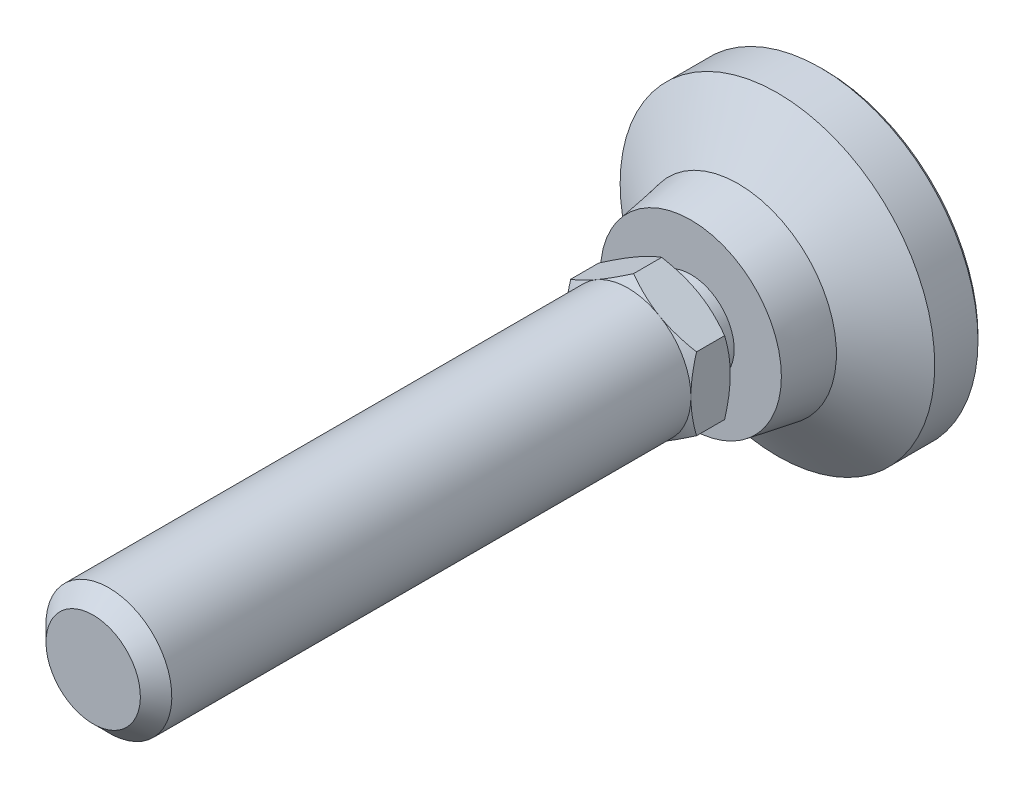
ISO-10303-21;
HEADER;
FILE_DESCRIPTION(('STEP AP214'),'2;1');
FILE_NAME('part.step','',(''),(''),'','','');
FILE_SCHEMA(('AUTOMOTIVE_DESIGN { 1 0 10303 214 1 1 1 1 }'));
ENDSEC;
DATA;
#1=APPLICATION_CONTEXT('core data for automotive mechanical design processes');
#2=APPLICATION_PROTOCOL_DEFINITION('international standard','automotive_design',2000,#1);
#3=PRODUCT_CONTEXT('',#1,'mechanical');
#4=PRODUCT('Part','Part','',(#3));
#5=PRODUCT_RELATED_PRODUCT_CATEGORY('part','',(#4));
#6=PRODUCT_DEFINITION_FORMATION('','',#4);
#7=PRODUCT_DEFINITION_CONTEXT('part definition',#1,'design');
#8=PRODUCT_DEFINITION('design','',#6,#7);
#9=PRODUCT_DEFINITION_SHAPE('','',#8);
#10=(LENGTH_UNIT() NAMED_UNIT(*) SI_UNIT(.MILLI.,.METRE.));
#11=(NAMED_UNIT(*) PLANE_ANGLE_UNIT() SI_UNIT($,.RADIAN.));
#12=(NAMED_UNIT(*) SI_UNIT($,.STERADIAN.) SOLID_ANGLE_UNIT());
#13=UNCERTAINTY_MEASURE_WITH_UNIT(LENGTH_MEASURE(1.E-05),#10,'distance_accuracy_value','');
#14=(GEOMETRIC_REPRESENTATION_CONTEXT(3) GLOBAL_UNCERTAINTY_ASSIGNED_CONTEXT((#13)) GLOBAL_UNIT_ASSIGNED_CONTEXT((#10,
#11,#12)) REPRESENTATION_CONTEXT('',''));
#15=CARTESIAN_POINT('',(0.,0.,0.));
#16=DIRECTION('',(0.,0.,1.));
#17=DIRECTION('',(1.,0.,0.));
#18=AXIS2_PLACEMENT_3D('',#15,#16,#17);
#19=CARTESIAN_POINT('',(0.,-5.50000000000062,19.9999999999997));
#20=DIRECTION('',(0.,0.,-1.));
#21=DIRECTION('',(0.,1.,0.));
#22=AXIS2_PLACEMENT_3D('',#19,#20,#21);
#23=PLANE('',#22);
#24=CARTESIAN_POINT('',(0.,0.,19.9999999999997));
#25=DIRECTION('',(0.,0.,-1.));
#26=DIRECTION('',(0.,1.,0.));
#27=AXIS2_PLACEMENT_3D('',#24,#25,#26);
#28=CIRCLE('',#27,5.50000000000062);
#29=CARTESIAN_POINT('',(0.,5.50000000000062,19.9999999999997));
#30=VERTEX_POINT('',#29);
#31=EDGE_CURVE('E286',#30,#30,#28,.T.);
#32=ORIENTED_EDGE('',*,*,#31,.F.);
#33=EDGE_LOOP('',(#32));
#34=FACE_BOUND('',#33,.T.);
#35=CARTESIAN_POINT('',(0.,0.,19.9999999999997));
#36=DIRECTION('',(0.,0.,-1.));
#37=DIRECTION('',(0.,1.,0.));
#38=AXIS2_PLACEMENT_3D('',#35,#36,#37);
#39=CIRCLE('',#38,8.00000000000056);
#40=CARTESIAN_POINT('',(-4.00000000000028,6.928203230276,19.9999999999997));
#41=VERTEX_POINT('',#40);
#42=CARTESIAN_POINT('',(4.00000000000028,6.928203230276,19.9999999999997));
#43=VERTEX_POINT('',#42);
#44=EDGE_CURVE('E18',#41,#43,#39,.T.);
#45=ORIENTED_EDGE('',*,*,#44,.T.);
#46=CARTESIAN_POINT('',(0.,0.,19.9999999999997));
#47=DIRECTION('',(0.,0.,-1.));
#48=DIRECTION('',(0.,1.,0.));
#49=AXIS2_PLACEMENT_3D('',#46,#47,#48);
#50=CIRCLE('',#49,8.00000000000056);
#51=CARTESIAN_POINT('',(8.00000000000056,0.,19.9999999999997));
#52=VERTEX_POINT('',#51);
#53=EDGE_CURVE('E30',#43,#52,#50,.T.);
#54=ORIENTED_EDGE('',*,*,#53,.T.);
#55=CARTESIAN_POINT('',(4.00000000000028,-6.928203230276,19.9999999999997));
#56=VERTEX_POINT('',#55);
#57=EDGE_CURVE('E9',#52,#56,#39,.T.);
#58=ORIENTED_EDGE('',*,*,#57,.T.);
#59=CARTESIAN_POINT('',(-4.00000000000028,-6.928203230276,19.9999999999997));
#60=VERTEX_POINT('',#59);
#61=EDGE_CURVE('E23',#56,#60,#39,.T.);
#62=ORIENTED_EDGE('',*,*,#61,.T.);
#63=CARTESIAN_POINT('',(-8.00000000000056,0.,19.9999999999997));
#64=VERTEX_POINT('',#63);
#65=EDGE_CURVE('E267',#60,#64,#39,.T.);
#66=ORIENTED_EDGE('',*,*,#65,.T.);
#67=EDGE_CURVE('E268',#64,#41,#39,.T.);
#68=ORIENTED_EDGE('',*,*,#67,.T.);
#69=EDGE_LOOP('',(#45,#54,#58,#62,#66,#68));
#70=FACE_BOUND('',#69,.T.);
#71=ADVANCED_FACE('F14',(#34,#70),#23,.T.);
#72=CARTESIAN_POINT('',(0.,0.,-1.));
#73=DIRECTION('',(0.,0.,-1.));
#74=DIRECTION('',(0.,1.,0.));
#75=AXIS2_PLACEMENT_3D('',#72,#73,#74);
#76=CYLINDRICAL_SURFACE('',#75,20.);
#77=CARTESIAN_POINT('',(0.,0.,0.500000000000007));
#78=DIRECTION('',(0.,0.,-1.));
#79=DIRECTION('',(0.,1.,0.));
#80=AXIS2_PLACEMENT_3D('',#77,#78,#79);
#81=CIRCLE('',#80,20.);
#82=CARTESIAN_POINT('',(0.,20.,0.500000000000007));
#83=VERTEX_POINT('',#82);
#84=EDGE_CURVE('E312',#83,#83,#81,.F.);
#85=ORIENTED_EDGE('',*,*,#84,.T.);
#86=EDGE_LOOP('',(#85));
#87=FACE_BOUND('',#86,.T.);
#88=CARTESIAN_POINT('',(0.,0.,6.));
#89=DIRECTION('',(0.,0.,-1.));
#90=DIRECTION('',(0.,1.,0.));
#91=AXIS2_PLACEMENT_3D('',#88,#89,#90);
#92=CIRCLE('',#91,20.);
#93=CARTESIAN_POINT('',(0.,20.,6.));
#94=VERTEX_POINT('',#93);
#95=EDGE_CURVE('E287',#94,#94,#92,.T.);
#96=ORIENTED_EDGE('',*,*,#95,.T.);
#97=EDGE_LOOP('',(#96));
#98=FACE_BOUND('',#97,.T.);
#99=ADVANCED_FACE('F335',(#87,#98),#76,.T.);
#100=CARTESIAN_POINT('',(0.,0.,-1.));
#101=DIRECTION('',(0.,0.,-1.));
#102=DIRECTION('',(0.,1.,0.));
#103=AXIS2_PLACEMENT_3D('',#100,#101,#102);
#104=CYLINDRICAL_SURFACE('',#103,5.50000000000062);
#105=CARTESIAN_POINT('',(0.,0.,17.));
#106=DIRECTION('',(0.,0.,-1.));
#107=DIRECTION('',(0.,1.,0.));
#108=AXIS2_PLACEMENT_3D('',#105,#106,#107);
#109=CIRCLE('',#108,5.50000000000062);
#110=CARTESIAN_POINT('',(0.,5.50000000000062,17.));
#111=VERTEX_POINT('',#110);
#112=EDGE_CURVE('E297',#111,#111,#109,.T.);
#113=ORIENTED_EDGE('',*,*,#112,.F.);
#114=EDGE_LOOP('',(#113));
#115=FACE_BOUND('',#114,.T.);
#116=ORIENTED_EDGE('',*,*,#31,.T.);
#117=EDGE_LOOP('',(#116));
#118=FACE_BOUND('',#117,.T.);
#119=ADVANCED_FACE('F341',(#115,#118),#104,.T.);
#120=CARTESIAN_POINT('',(-11.5,0.,17.));
#121=DIRECTION('',(0.,0.,-1.));
#122=DIRECTION('',(0.,1.,0.));
#123=AXIS2_PLACEMENT_3D('',#120,#121,#122);
#124=PLANE('',#123);
#125=CARTESIAN_POINT('',(0.,0.,17.));
#126=DIRECTION('',(0.,0.,-1.));
#127=DIRECTION('',(0.,1.,0.));
#128=AXIS2_PLACEMENT_3D('',#125,#126,#127);
#129=CIRCLE('',#128,11.5);
#130=CARTESIAN_POINT('',(0.,11.5,17.));
#131=VERTEX_POINT('',#130);
#132=EDGE_CURVE('E294',#131,#131,#129,.T.);
#133=ORIENTED_EDGE('',*,*,#132,.F.);
#134=EDGE_LOOP('',(#133));
#135=FACE_BOUND('',#134,.T.);
#136=ORIENTED_EDGE('',*,*,#112,.T.);
#137=EDGE_LOOP('',(#136));
#138=FACE_BOUND('',#137,.T.);
#139=ADVANCED_FACE('F532',(#135,#138),#124,.F.);
#140=CARTESIAN_POINT('',(0.,0.,17.));
#141=DIRECTION('',(0.,0.,-1.));
#142=DIRECTION('',(0.,1.,0.));
#143=AXIS2_PLACEMENT_3D('',#140,#141,#142);
#144=CONICAL_SURFACE('',#143,11.5,0.165148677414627);
#145=CARTESIAN_POINT('',(0.,0.,11.));
#146=DIRECTION('',(0.,0.,-1.));
#147=DIRECTION('',(0.,1.,0.));
#148=AXIS2_PLACEMENT_3D('',#145,#146,#147);
#149=CIRCLE('',#148,12.5);
#150=CARTESIAN_POINT('',(0.,12.5,11.));
#151=VERTEX_POINT('',#150);
#152=EDGE_CURVE('E290',#151,#151,#149,.T.);
#153=ORIENTED_EDGE('',*,*,#152,.F.);
#154=EDGE_LOOP('',(#153));
#155=FACE_BOUND('',#154,.T.);
#156=ORIENTED_EDGE('',*,*,#132,.T.);
#157=EDGE_LOOP('',(#156));
#158=FACE_BOUND('',#157,.T.);
#159=ADVANCED_FACE('F523',(#155,#158),#144,.T.);
#160=CARTESIAN_POINT('',(0.,0.,11.));
#161=DIRECTION('',(0.,0.,-1.));
#162=DIRECTION('',(0.,1.,0.));
#163=AXIS2_PLACEMENT_3D('',#160,#161,#162);
#164=CONICAL_SURFACE('',#163,12.5,0.982793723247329);
#165=ORIENTED_EDGE('',*,*,#95,.F.);
#166=EDGE_LOOP('',(#165));
#167=FACE_BOUND('',#166,.T.);
#168=ORIENTED_EDGE('',*,*,#152,.T.);
#169=EDGE_LOOP('',(#168));
#170=FACE_BOUND('',#169,.T.);
#171=ADVANCED_FACE('F516',(#167,#170),#164,.T.);
#172=CARTESIAN_POINT('',(0.,0.,0.));
#173=DIRECTION('',(0.,0.,-1.));
#174=DIRECTION('',(0.,1.,0.));
#175=AXIS2_PLACEMENT_3D('',#172,#173,#174);
#176=PLANE('',#175);
#177=CARTESIAN_POINT('',(0.,0.,0.));
#178=DIRECTION('',(0.,0.,-1.));
#179=DIRECTION('',(0.,1.,0.));
#180=AXIS2_PLACEMENT_3D('',#177,#178,#179);
#181=CIRCLE('',#180,19.5);
#182=CARTESIAN_POINT('',(0.,19.5,0.));
#183=VERTEX_POINT('',#182);
#184=EDGE_CURVE('E310',#183,#183,#181,.T.);
#185=ORIENTED_EDGE('',*,*,#184,.T.);
#186=EDGE_LOOP('',(#185));
#187=FACE_BOUND('',#186,.T.);
#188=ADVANCED_FACE('F233',(#187),#176,.T.);
#189=CARTESIAN_POINT('',(0.,0.,0.));
#190=DIRECTION('',(0.,0.,1.));
#191=DIRECTION('',(0.,-1.,0.));
#192=AXIS2_PLACEMENT_3D('',#189,#190,#191);
#193=CONICAL_SURFACE('',#192,19.5,0.785398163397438);
#194=ORIENTED_EDGE('',*,*,#84,.F.);
#195=EDGE_LOOP('',(#194));
#196=FACE_BOUND('',#195,.T.);
#197=ORIENTED_EDGE('',*,*,#184,.F.);
#198=EDGE_LOOP('',(#197));
#199=FACE_BOUND('',#198,.T.);
#200=ADVANCED_FACE('F16',(#196,#199),#193,.T.);
#201=CARTESIAN_POINT('',(0.,0.,19.9999999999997));
#202=DIRECTION('',(0.,0.,1.));
#203=DIRECTION('',(0.,-1.,0.));
#204=AXIS2_PLACEMENT_3D('',#201,#202,#203);
#205=CONICAL_SURFACE('',#204,8.00000000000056,1.0471975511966);
#206=ORIENTED_EDGE('',*,*,#44,.F.);
#207=CARTESIAN_POINT('',(0.000200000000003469,9.23771977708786,20.7145978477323));
#208=CARTESIAN_POINT('',(-0.175648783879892,9.13619343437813,20.6559907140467));
#209=CARTESIAN_POINT('',(-0.35215319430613,9.03428856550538,20.6000434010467));
#210=CARTESIAN_POINT('',(-0.706595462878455,8.82965122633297,20.494201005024));
#211=CARTESIAN_POINT('',(-0.884533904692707,8.72691841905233,20.4443085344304));
#212=CARTESIAN_POINT('',(-1.42119823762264,8.41707512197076,20.3046927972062));
#213=CARTESIAN_POINT('',(-1.78204258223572,8.20874154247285,20.2252811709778));
#214=CARTESIAN_POINT('',(-2.32203917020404,7.89697436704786,20.1321616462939));
#215=CARTESIAN_POINT('',(-2.49957818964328,7.79447216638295,20.1056345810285));
#216=CARTESIAN_POINT('',(-2.85545911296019,7.58900421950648,20.0611531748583));
#217=CARTESIAN_POINT('',(-3.03380094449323,7.48603851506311,20.043198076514));
#218=CARTESIAN_POINT('',(-3.39079168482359,7.27992981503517,20.0163156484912));
#219=CARTESIAN_POINT('',(-3.5694400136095,7.17678715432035,20.0073780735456));
#220=CARTESIAN_POINT('',(-3.92690170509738,6.97040655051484,19.9987223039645));
#221=CARTESIAN_POINT('',(-4.10571506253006,6.86716861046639,19.9990038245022));
#222=CARTESIAN_POINT('',(-4.4400133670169,6.67416139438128,20.0081450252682));
#223=CARTESIAN_POINT('',(-4.59552190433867,6.58437849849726,20.0158896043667));
#224=CARTESIAN_POINT('',(-4.90617476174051,6.40502298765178,20.0382011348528));
#225=CARTESIAN_POINT('',(-5.06131905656,6.31545038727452,20.0527685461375));
#226=CARTESIAN_POINT('',(-5.52615131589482,6.04707935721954,20.1063606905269));
#227=CARTESIAN_POINT('',(-5.83501648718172,5.86875596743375,20.1552686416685));
#228=CARTESIAN_POINT('',(-6.4560232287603,5.51021755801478,20.2775394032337));
#229=CARTESIAN_POINT('',(-6.76808554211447,5.33004829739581,20.3514205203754));
#230=CARTESIAN_POINT('',(-7.38755648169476,4.97239658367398,20.5191001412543));
#231=CARTESIAN_POINT('',(-7.69497304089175,4.79490955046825,20.6128592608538));
#232=CARTESIAN_POINT('',(-8.0002,4.61868668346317,20.7145978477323));
#233=B_SPLINE_CURVE_WITH_KNOTS('',3,(#207,#208,#209,#210,#211,#212,#213,#214,#215,#216,#217,
#218,#219,#220,#221,#222,#223,#224,#225,#226,#227,#228,#229,#230,#231,#232),.UNSPECIFIED.,.F.,
.F.,(4,2,2,2,2,2,2,2,2,2,2,2,4),(0.,0.633973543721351,1.26821965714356,2.53934712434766,
3.15934343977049,3.77928496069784,4.39852133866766,5.01773858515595,5.55680239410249,
6.09590254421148,7.17487077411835,8.27776850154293,9.37850115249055),.UNSPECIFIED.);
#234=CARTESIAN_POINT('',(0.,9.23760430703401,20.7145311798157));
#235=VERTEX_POINT('',#234);
#236=EDGE_CURVE('E242',#235,#41,#233,.T.);
#237=ORIENTED_EDGE('',*,*,#236,.F.);
#238=CARTESIAN_POINT('',(8.0002,4.61868668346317,20.7145978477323));
#239=CARTESIAN_POINT('',(7.8243512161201,4.7202130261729,20.6559907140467));
#240=CARTESIAN_POINT('',(7.64784680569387,4.82211789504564,20.6000434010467));
#241=CARTESIAN_POINT('',(7.29340453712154,5.02675523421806,20.494201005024));
#242=CARTESIAN_POINT('',(7.11546609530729,5.1294880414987,20.4443085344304));
#243=CARTESIAN_POINT('',(6.57880176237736,5.43933133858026,20.3046927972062));
#244=CARTESIAN_POINT('',(6.21795741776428,5.64766491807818,20.2252811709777));
#245=CARTESIAN_POINT('',(5.67796082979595,5.95943209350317,20.1321616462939));
#246=CARTESIAN_POINT('',(5.50042181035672,6.06193429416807,20.1056345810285));
#247=CARTESIAN_POINT('',(5.1445408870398,6.26740224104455,20.0611531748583));
#248=CARTESIAN_POINT('',(4.96619905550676,6.37036794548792,20.043198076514));
#249=CARTESIAN_POINT('',(4.60920831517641,6.57647664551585,20.0163156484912));
#250=CARTESIAN_POINT('',(4.4305599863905,6.67961930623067,20.0073780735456));
#251=CARTESIAN_POINT('',(4.07309829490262,6.88599991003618,19.9987223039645));
#252=CARTESIAN_POINT('',(3.89428493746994,6.98923785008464,19.9990038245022));
#253=CARTESIAN_POINT('',(3.5599866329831,7.18224506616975,20.0081450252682));
#254=CARTESIAN_POINT('',(3.40447809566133,7.27202796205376,20.0158896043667));
#255=CARTESIAN_POINT('',(3.09382523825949,7.45138347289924,20.0382011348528));
#256=CARTESIAN_POINT('',(2.93868094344,7.54095607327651,20.0527685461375));
#257=CARTESIAN_POINT('',(2.47384868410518,7.80932710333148,20.1063606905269));
#258=CARTESIAN_POINT('',(2.16498351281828,7.98765049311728,20.1552686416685));
#259=CARTESIAN_POINT('',(1.5439767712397,8.34618890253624,20.2775394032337));
#260=CARTESIAN_POINT('',(1.23191445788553,8.52635816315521,20.3514205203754));
#261=CARTESIAN_POINT('',(0.612443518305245,8.88400987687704,20.5191001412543));
#262=CARTESIAN_POINT('',(0.305026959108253,9.06149691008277,20.6128592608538));
#263=CARTESIAN_POINT('',(-0.000199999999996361,9.23771977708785,20.7145978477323));
#264=B_SPLINE_CURVE_WITH_KNOTS('',3,(#238,#239,#240,#241,#242,#243,#244,#245,#246,#247,#248,
#249,#250,#251,#252,#253,#254,#255,#256,#257,#258,#259,#260,#261,#262,#263),.UNSPECIFIED.,.F.,
.F.,(4,2,2,2,2,2,2,2,2,2,2,2,4),(0.,0.633973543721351,1.26821965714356,2.53934712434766,
3.15934343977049,3.77928496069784,4.39852133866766,5.01773858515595,5.55680239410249,
6.09590254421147,7.17487077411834,8.27776850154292,9.37850115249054),.UNSPECIFIED.);
#265=EDGE_CURVE('E241',#43,#235,#264,.T.);
#266=ORIENTED_EDGE('',*,*,#265,.F.);
#267=EDGE_LOOP('',(#206,#237,#266));
#268=FACE_BOUND('',#267,.T.);
#269=ADVANCED_FACE('F324',(#268),#205,.T.);
#270=CARTESIAN_POINT('',(-8.,4.61880215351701,20.7145311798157));
#271=VERTEX_POINT('',#270);
#272=EDGE_CURVE('E126',#41,#271,#233,.T.);
#273=ORIENTED_EDGE('',*,*,#272,.F.);
#274=ORIENTED_EDGE('',*,*,#67,.F.);
#275=CARTESIAN_POINT('',(-8.,12.3496151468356,23.8765494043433));
#276=CARTESIAN_POINT('',(-8.,12.0006820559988,23.7075157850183));
#277=CARTESIAN_POINT('',(-8.,11.6509418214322,23.5401195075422));
#278=CARTESIAN_POINT('',(-8.,10.9494176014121,23.2095236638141));
#279=CARTESIAN_POINT('',(-8.,10.5976332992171,23.0463247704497));
#280=CARTESIAN_POINT('',(-8.,9.88975139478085,22.7242123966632));
#281=CARTESIAN_POINT('',(-8.,9.5336406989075,22.5653275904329));
#282=CARTESIAN_POINT('',(-8.,8.81856698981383,22.2541366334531));
#283=CARTESIAN_POINT('',(-8.,8.45960411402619,22.1018301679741));
#284=CARTESIAN_POINT('',(-8.,7.72687977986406,21.8008622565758));
#285=CARTESIAN_POINT('',(-8.,7.35300841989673,21.6524668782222));
#286=CARTESIAN_POINT('',(-8.,6.60087150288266,21.3670459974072));
#287=CARTESIAN_POINT('',(-8.,6.22260545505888,21.2300217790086));
#288=CARTESIAN_POINT('',(-8.,5.46179948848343,20.9709827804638));
#289=CARTESIAN_POINT('',(-8.,5.07927020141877,20.8489371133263));
#290=CARTESIAN_POINT('',(-8.,4.30873883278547,20.6238073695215));
#291=CARTESIAN_POINT('',(-8.,3.92073853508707,20.5207172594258));
#292=CARTESIAN_POINT('',(-8.,3.14112823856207,20.3390370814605));
#293=CARTESIAN_POINT('',(-8.,2.74954963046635,20.2603159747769));
#294=CARTESIAN_POINT('',(-8.,2.15866192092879,20.1639462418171));
#295=CARTESIAN_POINT('',(-8.,1.96109773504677,20.135440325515));
#296=CARTESIAN_POINT('',(-8.,1.56500689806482,20.0862261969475));
#297=CARTESIAN_POINT('',(-8.,1.36648034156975,20.0655172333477));
#298=CARTESIAN_POINT('',(-8.,0.97129865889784,20.03256633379));
#299=CARTESIAN_POINT('',(-8.,0.774652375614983,20.0202187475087));
#300=CARTESIAN_POINT('',(-8.,0.381014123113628,20.0038464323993));
#301=CARTESIAN_POINT('',(-8.,0.184022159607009,19.9998215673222));
#302=CARTESIAN_POINT('',(-8.,-0.209955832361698,20.0001905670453));
#303=CARTESIAN_POINT('',(-8.,-0.406941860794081,20.0045844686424));
#304=CARTESIAN_POINT('',(-8.,-0.800555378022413,20.0216845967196));
#305=CARTESIAN_POINT('',(-8.,-0.997182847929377,20.0343912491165));
#306=CARTESIAN_POINT('',(-8.,-1.47149398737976,20.0748020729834));
#307=CARTESIAN_POINT('',(-8.,-1.74884040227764,20.1065478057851));
#308=CARTESIAN_POINT('',(-8.,-2.30142392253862,20.1848324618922));
#309=CARTESIAN_POINT('',(-8.,-2.57666072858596,20.2313734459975));
#310=CARTESIAN_POINT('',(-8.,-3.39892148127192,20.3907170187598));
#311=CARTESIAN_POINT('',(-8.,-3.94217741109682,20.523209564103));
#312=CARTESIAN_POINT('',(-8.,-4.75439104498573,20.7523170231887));
#313=CARTESIAN_POINT('',(-8.,-5.02757821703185,20.8347949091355));
#314=CARTESIAN_POINT('',(-8.,-5.5712982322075,21.0081570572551));
#315=CARTESIAN_POINT('',(-8.,-5.84183105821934,21.0990413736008));
#316=CARTESIAN_POINT('',(-8.,-6.38033035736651,21.2877715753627));
#317=CARTESIAN_POINT('',(-8.,-6.64829768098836,21.3856150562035));
#318=CARTESIAN_POINT('',(-8.,-7.18202324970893,21.5871283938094));
#319=CARTESIAN_POINT('',(-8.,-7.44778151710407,21.6907981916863));
#320=CARTESIAN_POINT('',(-8.,-8.0598054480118,21.9360406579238));
#321=CARTESIAN_POINT('',(-8.,-8.40536863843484,22.079362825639));
#322=CARTESIAN_POINT('',(-8.,-9.09367440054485,22.372645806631));
#323=CARTESIAN_POINT('',(-8.,-9.43641681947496,22.5226069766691));
#324=CARTESIAN_POINT('',(-8.,-10.1195796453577,22.8278774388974));
#325=CARTESIAN_POINT('',(-8.,-10.4599996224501,22.983187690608));
#326=CARTESIAN_POINT('',(-8.,-11.1388422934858,23.298120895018));
#327=CARTESIAN_POINT('',(-8.,-11.4772649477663,23.457743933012));
#328=CARTESIAN_POINT('',(-8.,-12.1527555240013,23.7806734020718));
#329=CARTESIAN_POINT('',(-8.,-12.4898217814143,23.9439833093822));
#330=CARTESIAN_POINT('',(-8.,-13.1625242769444,24.2735248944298));
#331=CARTESIAN_POINT('',(-8.,-13.4981605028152,24.4397565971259));
#332=CARTESIAN_POINT('',(-8.,-14.5031753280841,24.9420390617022));
#333=CARTESIAN_POINT('',(-8.,-15.1707413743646,25.2817163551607));
#334=CARTESIAN_POINT('',(-8.,-16.4489507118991,25.9404306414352));
#335=CARTESIAN_POINT('',(-8.,-17.0598673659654,26.2589394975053));
#336=CARTESIAN_POINT('',(-8.,-18.279406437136,26.9003627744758));
#337=CARTESIAN_POINT('',(-8.,-18.8880287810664,27.2232773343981));
#338=CARTESIAN_POINT('',(-8.,-20.1020595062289,27.8717232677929));
#339=CARTESIAN_POINT('',(-8.,-20.7074720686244,28.1972468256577));
#340=CARTESIAN_POINT('',(-8.,-21.9168207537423,28.8509519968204));
#341=CARTESIAN_POINT('',(-8.,-22.5207569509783,29.1791334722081));
#342=CARTESIAN_POINT('',(-8.,-23.124145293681,29.5083123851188));
#343=B_SPLINE_CURVE_WITH_KNOTS('',3,(#275,#276,#277,#278,#279,#280,#281,#282,#283,#284,#285,
#286,#287,#288,#289,#290,#291,#292,#293,#294,#295,#296,#297,#298,#299,#300,#301,#302,#303,#304,
#305,#306,#307,#308,#309,#310,#311,#312,#313,#314,#315,#316,#317,#318,#319,#320,#321,#322,#323,
#324,#325,#326,#327,#328,#329,#330,#331,#332,#333,#334,#335,#336,#337,#338,#339,#340,#341,#342),
.UNSPECIFIED.,.F.,.F.,(4,2,2,2,2,2,2,2,2,2,2,2,2,2,2,2,2,2,2,2,2,2,2,2,2,2,2,2,2,2,2,2,2,4),(0.,
1.16317396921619,2.32653326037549,3.49632308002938,4.66605687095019,5.87264817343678,
7.07937554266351,8.28357117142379,9.48738284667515,10.684604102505,11.2833047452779,
11.8819476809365,12.4728777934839,13.0637982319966,13.6547212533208,14.2456745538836,
15.0826723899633,15.9197868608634,17.5949709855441,18.45100009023,19.307034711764,
20.1627749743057,21.0185065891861,22.1407322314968,23.2630182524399,24.3855066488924,
25.5080172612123,26.6316345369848,27.7552614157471,30.0022444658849,32.0691077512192,
34.1360364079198,36.1981665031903,38.2601902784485),.UNSPECIFIED.);
#344=EDGE_CURVE('E38',#271,#64,#343,.T.);
#345=ORIENTED_EDGE('',*,*,#344,.F.);
#346=EDGE_LOOP('',(#273,#274,#345));
#347=FACE_BOUND('',#346,.T.);
#348=ADVANCED_FACE('F155',(#347),#205,.T.);
#349=CARTESIAN_POINT('',(-8.,-4.618802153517,20.7145311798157));
#350=VERTEX_POINT('',#349);
#351=EDGE_CURVE('E243',#64,#350,#343,.T.);
#352=ORIENTED_EDGE('',*,*,#351,.F.);
#353=ORIENTED_EDGE('',*,*,#65,.F.);
#354=CARTESIAN_POINT('',(-8.0002,-4.61868668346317,20.7145978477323));
#355=CARTESIAN_POINT('',(-7.8243512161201,-4.7202130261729,20.6559907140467));
#356=CARTESIAN_POINT('',(-7.64784680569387,-4.82211789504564,20.6000434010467));
#357=CARTESIAN_POINT('',(-7.29340453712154,-5.02675523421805,20.494201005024));
#358=CARTESIAN_POINT('',(-7.11546609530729,-5.12948804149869,20.4443085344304));
#359=CARTESIAN_POINT('',(-6.57880176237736,-5.43933133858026,20.3046927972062));
#360=CARTESIAN_POINT('',(-6.21795741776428,-5.64766491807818,20.2252811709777));
#361=CARTESIAN_POINT('',(-5.67796082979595,-5.95943209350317,20.1321616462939));
#362=CARTESIAN_POINT('',(-5.50042181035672,-6.06193429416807,20.1056345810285));
#363=CARTESIAN_POINT('',(-5.1445408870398,-6.26740224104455,20.0611531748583));
#364=CARTESIAN_POINT('',(-4.96619905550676,-6.37036794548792,20.043198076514));
#365=CARTESIAN_POINT('',(-4.60920831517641,-6.57647664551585,20.0163156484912));
#366=CARTESIAN_POINT('',(-4.4305599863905,-6.67961930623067,20.0073780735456));
#367=CARTESIAN_POINT('',(-4.07309829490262,-6.88599991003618,19.9987223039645));
#368=CARTESIAN_POINT('',(-3.89428493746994,-6.98923785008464,19.9990038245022));
#369=CARTESIAN_POINT('',(-3.5599866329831,-7.18224506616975,20.0081450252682));
#370=CARTESIAN_POINT('',(-3.40447809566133,-7.27202796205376,20.0158896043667));
#371=CARTESIAN_POINT('',(-3.09382523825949,-7.45138347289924,20.0382011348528));
#372=CARTESIAN_POINT('',(-2.93868094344,-7.5409560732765,20.0527685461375));
#373=CARTESIAN_POINT('',(-2.47384868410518,-7.80932710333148,20.1063606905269));
#374=CARTESIAN_POINT('',(-2.16498351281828,-7.98765049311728,20.1552686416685));
#375=CARTESIAN_POINT('',(-1.5439767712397,-8.34618890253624,20.2775394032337));
#376=CARTESIAN_POINT('',(-1.23191445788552,-8.52635816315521,20.3514205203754));
#377=CARTESIAN_POINT('',(-0.612443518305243,-8.88400987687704,20.5191001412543));
#378=CARTESIAN_POINT('',(-0.305026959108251,-9.06149691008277,20.6128592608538));
#379=CARTESIAN_POINT('',(0.000199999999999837,-9.23771977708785,20.7145978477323));
#380=B_SPLINE_CURVE_WITH_KNOTS('',3,(#354,#355,#356,#357,#358,#359,#360,#361,#362,#363,#364,
#365,#366,#367,#368,#369,#370,#371,#372,#373,#374,#375,#376,#377,#378,#379),.UNSPECIFIED.,.F.,
.F.,(4,2,2,2,2,2,2,2,2,2,2,2,4),(0.,0.63397354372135,1.26821965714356,2.53934712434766,
3.15934343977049,3.77928496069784,4.39852133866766,5.01773858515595,5.55680239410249,
6.09590254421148,7.17487077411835,8.27776850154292,9.37850115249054),.UNSPECIFIED.);
#381=EDGE_CURVE('E113',#350,#60,#380,.T.);
#382=ORIENTED_EDGE('',*,*,#381,.F.);
#383=EDGE_LOOP('',(#352,#353,#382));
#384=FACE_BOUND('',#383,.T.);
#385=ADVANCED_FACE('F265',(#384),#205,.T.);
#386=CARTESIAN_POINT('',(0.,-9.23760430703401,20.7145311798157));
#387=VERTEX_POINT('',#386);
#388=EDGE_CURVE('E133',#60,#387,#380,.T.);
#389=ORIENTED_EDGE('',*,*,#388,.F.);
#390=ORIENTED_EDGE('',*,*,#61,.F.);
#391=CARTESIAN_POINT('',(-0.0002,-9.23771977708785,20.7145978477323));
#392=CARTESIAN_POINT('',(0.175648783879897,-9.13619343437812,20.6559907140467));
#393=CARTESIAN_POINT('',(0.352153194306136,-9.03428856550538,20.6000434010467));
#394=CARTESIAN_POINT('',(0.706595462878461,-8.82965122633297,20.494201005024));
#395=CARTESIAN_POINT('',(0.884533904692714,-8.72691841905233,20.4443085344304));
#396=CARTESIAN_POINT('',(1.42119823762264,-8.41707512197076,20.3046927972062));
#397=CARTESIAN_POINT('',(1.78204258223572,-8.20874154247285,20.2252811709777));
#398=CARTESIAN_POINT('',(2.32203917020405,-7.89697436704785,20.1321616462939));
#399=CARTESIAN_POINT('',(2.49957818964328,-7.79447216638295,20.1056345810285));
#400=CARTESIAN_POINT('',(2.8554591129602,-7.58900421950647,20.0611531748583));
#401=CARTESIAN_POINT('',(3.03380094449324,-7.4860385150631,20.043198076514));
#402=CARTESIAN_POINT('',(3.39079168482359,-7.27992981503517,20.0163156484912));
#403=CARTESIAN_POINT('',(3.5694400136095,-7.17678715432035,20.0073780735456));
#404=CARTESIAN_POINT('',(3.92690170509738,-6.97040655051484,19.9987223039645));
#405=CARTESIAN_POINT('',(4.10571506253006,-6.86716861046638,19.9990038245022));
#406=CARTESIAN_POINT('',(4.4400133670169,-6.67416139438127,20.0081450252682));
#407=CARTESIAN_POINT('',(4.59552190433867,-6.58437849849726,20.0158896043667));
#408=CARTESIAN_POINT('',(4.90617476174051,-6.40502298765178,20.0382011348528));
#409=CARTESIAN_POINT('',(5.06131905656,-6.31545038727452,20.0527685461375));
#410=CARTESIAN_POINT('',(5.52615131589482,-6.04707935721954,20.1063606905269));
#411=CARTESIAN_POINT('',(5.83501648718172,-5.86875596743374,20.1552686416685));
#412=CARTESIAN_POINT('',(6.4560232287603,-5.51021755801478,20.2775394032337));
#413=CARTESIAN_POINT('',(6.76808554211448,-5.33004829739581,20.3514205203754));
#414=CARTESIAN_POINT('',(7.38755648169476,-4.97239658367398,20.5191001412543));
#415=CARTESIAN_POINT('',(7.69497304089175,-4.79490955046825,20.6128592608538));
#416=CARTESIAN_POINT('',(8.0002,-4.61868668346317,20.7145978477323));
#417=B_SPLINE_CURVE_WITH_KNOTS('',3,(#391,#392,#393,#394,#395,#396,#397,#398,#399,#400,#401,
#402,#403,#404,#405,#406,#407,#408,#409,#410,#411,#412,#413,#414,#415,#416),.UNSPECIFIED.,.F.,
.F.,(4,2,2,2,2,2,2,2,2,2,2,2,4),(0.,0.63397354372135,1.26821965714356,2.53934712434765,
3.15934343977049,3.77928496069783,4.39852133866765,5.01773858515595,5.55680239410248,
6.09590254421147,7.17487077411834,8.27776850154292,9.37850115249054),.UNSPECIFIED.);
#418=EDGE_CURVE('E271',#387,#56,#417,.T.);
#419=ORIENTED_EDGE('',*,*,#418,.F.);
#420=EDGE_LOOP('',(#389,#390,#419));
#421=FACE_BOUND('',#420,.T.);
#422=ADVANCED_FACE('F270',(#421),#205,.T.);
#423=ORIENTED_EDGE('',*,*,#57,.F.);
#424=CARTESIAN_POINT('',(8.,12.3496151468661,23.876549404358));
#425=CARTESIAN_POINT('',(8.,12.0006820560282,23.7075157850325));
#426=CARTESIAN_POINT('',(8.,11.6509418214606,23.5401195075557));
#427=CARTESIAN_POINT('',(8.,10.9494176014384,23.2095236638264));
#428=CARTESIAN_POINT('',(8.,10.5976332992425,23.0463247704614));
#429=CARTESIAN_POINT('',(8.,9.88975139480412,22.7242123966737));
#430=CARTESIAN_POINT('',(8.,9.53364069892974,22.5653275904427));
#431=CARTESIAN_POINT('',(8.,8.81856698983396,22.2541366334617));
#432=CARTESIAN_POINT('',(8.,8.45960411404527,22.1018301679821));
#433=CARTESIAN_POINT('',(8.,7.72687977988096,21.8008622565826));
#434=CARTESIAN_POINT('',(8.,7.35300841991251,21.6524668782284));
#435=CARTESIAN_POINT('',(8.,6.60087150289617,21.3670459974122));
#436=CARTESIAN_POINT('',(8.,6.22260545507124,21.2300217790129));
#437=CARTESIAN_POINT('',(8.,5.46179948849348,20.9709827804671));
#438=CARTESIAN_POINT('',(8.,5.07927020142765,20.848937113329));
#439=CARTESIAN_POINT('',(8.,4.30873883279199,20.6238073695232));
#440=CARTESIAN_POINT('',(8.,3.92073853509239,20.5207172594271));
#441=CARTESIAN_POINT('',(8.,3.14112823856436,20.3390370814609));
#442=CARTESIAN_POINT('',(8.,2.7495496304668,20.2603159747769));
#443=CARTESIAN_POINT('',(8.,2.15866192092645,20.1639462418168));
#444=CARTESIAN_POINT('',(8.,1.96109773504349,20.1354403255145));
#445=CARTESIAN_POINT('',(8.,1.56500689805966,20.0862261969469));
#446=CARTESIAN_POINT('',(8.,1.36648034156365,20.0655172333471));
#447=CARTESIAN_POINT('',(8.,0.971298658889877,20.0325663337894));
#448=CARTESIAN_POINT('',(8.,0.774652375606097,20.0202187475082));
#449=CARTESIAN_POINT('',(8.,0.381014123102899,20.003846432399));
#450=CARTESIAN_POINT('',(8.,0.184022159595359,19.999821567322));
#451=CARTESIAN_POINT('',(8.,-0.209955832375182,20.0001905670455));
#452=CARTESIAN_POINT('',(8.,-0.406941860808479,20.0045844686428));
#453=CARTESIAN_POINT('',(8.,-0.800555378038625,20.0216845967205));
#454=CARTESIAN_POINT('',(8.,-0.99718284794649,20.0343912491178));
#455=CARTESIAN_POINT('',(8.,-1.47149398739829,20.0748020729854));
#456=CARTESIAN_POINT('',(8.,-1.74884040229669,20.1065478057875));
#457=CARTESIAN_POINT('',(8.,-2.30142392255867,20.1848324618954));
#458=CARTESIAN_POINT('',(8.,-2.57666072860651,20.2313734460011));
#459=CARTESIAN_POINT('',(8.,-3.39892148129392,20.3907170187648));
#460=CARTESIAN_POINT('',(8.,-3.94217741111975,20.5232095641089));
#461=CARTESIAN_POINT('',(8.,-4.75439104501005,20.7523170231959));
#462=CARTESIAN_POINT('',(8.,-5.02757821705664,20.8347949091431));
#463=CARTESIAN_POINT('',(8.,-5.57129823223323,21.0081570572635));
#464=CARTESIAN_POINT('',(8.,-5.84183105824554,21.0990413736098));
#465=CARTESIAN_POINT('',(8.,-6.38033035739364,21.2877715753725));
#466=CARTESIAN_POINT('',(8.,-6.64829768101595,21.3856150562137));
#467=CARTESIAN_POINT('',(8.,-7.18202324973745,21.5871283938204));
#468=CARTESIAN_POINT('',(8.,-7.44778151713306,21.6907981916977));
#469=CARTESIAN_POINT('',(8.,-8.05980544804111,21.9360406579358));
#470=CARTESIAN_POINT('',(8.,-8.40536863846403,22.0793628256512));
#471=CARTESIAN_POINT('',(8.,-9.0936744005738,22.3726458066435));
#472=CARTESIAN_POINT('',(8.,-9.43641681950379,22.5226069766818));
#473=CARTESIAN_POINT('',(8.,-10.1195796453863,22.8278774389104));
#474=CARTESIAN_POINT('',(8.,-10.4599996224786,22.9831876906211));
#475=CARTESIAN_POINT('',(8.,-11.1388422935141,23.2981208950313));
#476=CARTESIAN_POINT('',(8.,-11.4772649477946,23.4577439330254));
#477=CARTESIAN_POINT('',(8.,-12.1527555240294,23.7806734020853));
#478=CARTESIAN_POINT('',(8.,-12.4898217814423,23.9439833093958));
#479=CARTESIAN_POINT('',(8.,-13.1625242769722,24.2735248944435));
#480=CARTESIAN_POINT('',(8.,-13.4981605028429,24.4397565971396));
#481=CARTESIAN_POINT('',(8.,-14.5031753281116,24.9420390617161));
#482=CARTESIAN_POINT('',(8.,-15.1707413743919,25.2817163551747));
#483=CARTESIAN_POINT('',(8.,-16.4489507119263,25.9404306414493));
#484=CARTESIAN_POINT('',(8.,-17.0598673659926,26.2589394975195));
#485=CARTESIAN_POINT('',(8.,-18.2794064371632,26.9003627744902));
#486=CARTESIAN_POINT('',(7.99999999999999,-18.8880287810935,27.2232773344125));
#487=CARTESIAN_POINT('',(7.99999999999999,-20.1020595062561,27.8717232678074));
#488=CARTESIAN_POINT('',(7.99999999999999,-20.7074720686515,28.1972468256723));
#489=CARTESIAN_POINT('',(7.99999999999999,-21.9168207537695,28.8509519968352));
#490=CARTESIAN_POINT('',(8.,-22.5207569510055,29.1791334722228));
#491=CARTESIAN_POINT('',(8.,-23.1241452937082,29.5083123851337));
#492=B_SPLINE_CURVE_WITH_KNOTS('',3,(#424,#425,#426,#427,#428,#429,#430,#431,#432,#433,#434,
#435,#436,#437,#438,#439,#440,#441,#442,#443,#444,#445,#446,#447,#448,#449,#450,#451,#452,#453,
#454,#455,#456,#457,#458,#459,#460,#461,#462,#463,#464,#465,#466,#467,#468,#469,#470,#471,#472,
#473,#474,#475,#476,#477,#478,#479,#480,#481,#482,#483,#484,#485,#486,#487,#488,#489,#490,#491),
.UNSPECIFIED.,.F.,.F.,(4,2,2,2,2,2,2,2,2,2,2,2,2,2,2,2,2,2,2,2,2,2,2,2,2,2,2,2,2,2,2,2,2,4),(0.,
1.16317396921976,2.32653326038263,3.49632308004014,4.66605687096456,5.87264817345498,
7.07937554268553,8.28357117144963,9.4873828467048,10.6846041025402,11.283304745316,
11.8819476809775,12.4728777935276,13.063798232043,13.65472125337,14.2456745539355,
15.0826723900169,15.9197868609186,17.5949709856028,18.4510000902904,19.3070347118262,
20.1627749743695,21.0185065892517,22.1407322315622,23.2630182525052,24.3855066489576,
25.5080172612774,26.6316345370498,27.7552614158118,30.0022444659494,32.0691077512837,
34.1360364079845,36.198166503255,38.2601902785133),.UNSPECIFIED.);
#493=CARTESIAN_POINT('',(8.,-4.61880215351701,20.7145311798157));
#494=VERTEX_POINT('',#493);
#495=EDGE_CURVE('E112',#494,#52,#492,.F.);
#496=ORIENTED_EDGE('',*,*,#495,.F.);
#497=EDGE_CURVE('E118',#56,#494,#417,.T.);
#498=ORIENTED_EDGE('',*,*,#497,.F.);
#499=EDGE_LOOP('',(#423,#496,#498));
#500=FACE_BOUND('',#499,.T.);
#501=ADVANCED_FACE('F116',(#500),#205,.T.);
#502=ORIENTED_EDGE('',*,*,#53,.F.);
#503=CARTESIAN_POINT('',(8.,4.61880215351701,20.7145311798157));
#504=VERTEX_POINT('',#503);
#505=EDGE_CURVE('E107',#504,#43,#264,.T.);
#506=ORIENTED_EDGE('',*,*,#505,.F.);
#507=EDGE_CURVE('E103',#52,#504,#492,.F.);
#508=ORIENTED_EDGE('',*,*,#507,.F.);
#509=EDGE_LOOP('',(#502,#506,#508));
#510=FACE_BOUND('',#509,.T.);
#511=ADVANCED_FACE('F105',(#510),#205,.T.);
#512=CARTESIAN_POINT('',(-6.00000000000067,0.,93.));
#513=DIRECTION('',(0.,0.,-1.));
#514=DIRECTION('',(0.,1.,0.));
#515=AXIS2_PLACEMENT_3D('',#512,#513,#514);
#516=PLANE('',#515);
#517=CARTESIAN_POINT('',(0.,0.,93.));
#518=DIRECTION('',(0.,0.,-1.));
#519=DIRECTION('',(0.,1.,0.));
#520=AXIS2_PLACEMENT_3D('',#517,#518,#519);
#521=CIRCLE('',#520,6.00000000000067);
#522=CARTESIAN_POINT('',(0.,6.00000000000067,93.));
#523=VERTEX_POINT('',#522);
#524=EDGE_CURVE('E303',#523,#523,#521,.T.);
#525=ORIENTED_EDGE('',*,*,#524,.F.);
#526=EDGE_LOOP('',(#525));
#527=FACE_BOUND('',#526,.T.);
#528=ADVANCED_FACE('F459',(#527),#516,.F.);
#529=CARTESIAN_POINT('',(0.,0.,93.));
#530=DIRECTION('',(0.,0.,-1.));
#531=DIRECTION('',(0.,1.,0.));
#532=AXIS2_PLACEMENT_3D('',#529,#530,#531);
#533=CONICAL_SURFACE('',#532,6.00000000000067,0.785398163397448);
#534=CARTESIAN_POINT('',(0.,0.,91.));
#535=DIRECTION('',(0.,0.,-1.));
#536=DIRECTION('',(0.,1.,0.));
#537=AXIS2_PLACEMENT_3D('',#534,#535,#536);
#538=CIRCLE('',#537,8.00000000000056);
#539=CARTESIAN_POINT('',(0.,8.00000000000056,91.));
#540=VERTEX_POINT('',#539);
#541=EDGE_CURVE('E300',#540,#540,#538,.T.);
#542=ORIENTED_EDGE('',*,*,#541,.F.);
#543=EDGE_LOOP('',(#542));
#544=FACE_BOUND('',#543,.T.);
#545=ORIENTED_EDGE('',*,*,#524,.T.);
#546=EDGE_LOOP('',(#545));
#547=FACE_BOUND('',#546,.T.);
#548=ADVANCED_FACE('F450',(#544,#547),#533,.T.);
#549=CARTESIAN_POINT('',(0.,0.,-1.));
#550=DIRECTION('',(0.,0.,-1.));
#551=DIRECTION('',(0.,1.,0.));
#552=AXIS2_PLACEMENT_3D('',#549,#550,#551);
#553=CYLINDRICAL_SURFACE('',#552,8.00000000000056);
#554=ORIENTED_EDGE('',*,*,#541,.T.);
#555=EDGE_LOOP('',(#554));
#556=FACE_BOUND('',#555,.T.);
#557=CARTESIAN_POINT('',(0.,0.,25.));
#558=DIRECTION('',(0.,0.,-1.));
#559=DIRECTION('',(0.,1.,0.));
#560=AXIS2_PLACEMENT_3D('',#557,#558,#559);
#561=CIRCLE('',#560,8.00000000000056);
#562=CARTESIAN_POINT('',(4.,6.92820323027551,25.));
#563=VERTEX_POINT('',#562);
#564=CARTESIAN_POINT('',(8.,0.,25.));
#565=VERTEX_POINT('',#564);
#566=EDGE_CURVE('E273',#563,#565,#561,.T.);
#567=ORIENTED_EDGE('',*,*,#566,.F.);
#568=CARTESIAN_POINT('',(0.,0.,25.));
#569=DIRECTION('',(0.,0.,-1.));
#570=DIRECTION('',(0.,1.,0.));
#571=AXIS2_PLACEMENT_3D('',#568,#569,#570);
#572=CIRCLE('',#571,8.00000000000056);
#573=CARTESIAN_POINT('',(-4.,6.92820323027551,25.));
#574=VERTEX_POINT('',#573);
#575=EDGE_CURVE('E306',#574,#563,#572,.T.);
#576=ORIENTED_EDGE('',*,*,#575,.F.);
#577=CARTESIAN_POINT('',(-8.,0.,25.));
#578=VERTEX_POINT('',#577);
#579=EDGE_CURVE('E308',#578,#574,#572,.T.);
#580=ORIENTED_EDGE('',*,*,#579,.F.);
#581=CARTESIAN_POINT('',(-4.,-6.92820323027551,25.));
#582=VERTEX_POINT('',#581);
#583=EDGE_CURVE('E357',#582,#578,#572,.T.);
#584=ORIENTED_EDGE('',*,*,#583,.F.);
#585=CARTESIAN_POINT('',(4.,-6.92820323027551,25.));
#586=VERTEX_POINT('',#585);
#587=EDGE_CURVE('E602',#586,#582,#572,.T.);
#588=ORIENTED_EDGE('',*,*,#587,.F.);
#589=EDGE_CURVE('E309',#565,#586,#572,.T.);
#590=ORIENTED_EDGE('',*,*,#589,.F.);
#591=EDGE_LOOP('',(#567,#576,#580,#584,#588,#590));
#592=FACE_BOUND('',#591,.T.);
#593=ADVANCED_FACE('F359',(#556,#592),#553,.T.);
#594=CARTESIAN_POINT('',(0.,0.,23.567451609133));
#595=DIRECTION('',(0.,0.,-1.));
#596=DIRECTION('',(0.,1.,0.));
#597=AXIS2_PLACEMENT_3D('',#594,#595,#596);
#598=CONICAL_SURFACE('',#597,10.4812465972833,1.0471975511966);
#599=ORIENTED_EDGE('',*,*,#566,.T.);
#600=CARTESIAN_POINT('',(8.,12.3496151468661,21.1234505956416));
#601=CARTESIAN_POINT('',(8.,12.0006820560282,21.2924842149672));
#602=CARTESIAN_POINT('',(8.,11.6509418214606,21.459880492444));
#603=CARTESIAN_POINT('',(8.,10.9494176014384,21.7904763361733));
#604=CARTESIAN_POINT('',(8.,10.5976332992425,21.9536752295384));
#605=CARTESIAN_POINT('',(8.,9.88975139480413,22.2757876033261));
#606=CARTESIAN_POINT('',(8.,9.53364069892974,22.434672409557));
#607=CARTESIAN_POINT('',(8.,8.81856698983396,22.745863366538));
#608=CARTESIAN_POINT('',(8.,8.45960411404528,22.8981698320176));
#609=CARTESIAN_POINT('',(8.,7.72687977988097,23.1991377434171));
#610=CARTESIAN_POINT('',(8.,7.35300841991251,23.3475331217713));
#611=CARTESIAN_POINT('',(8.,6.60087150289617,23.6329540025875));
#612=CARTESIAN_POINT('',(8.,6.22260545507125,23.7699782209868));
#613=CARTESIAN_POINT('',(8.,5.46179948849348,24.0290172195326));
#614=CARTESIAN_POINT('',(8.,5.07927020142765,24.1510628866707));
#615=CARTESIAN_POINT('',(8.,4.30873883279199,24.3761926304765));
#616=CARTESIAN_POINT('',(8.,3.92073853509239,24.4792827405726));
#617=CARTESIAN_POINT('',(8.,3.14112823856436,24.6609629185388));
#618=CARTESIAN_POINT('',(8.,2.7495496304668,24.7396840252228));
#619=CARTESIAN_POINT('',(8.,2.15866192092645,24.8360537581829));
#620=CARTESIAN_POINT('',(8.,1.96109773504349,24.8645596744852));
#621=CARTESIAN_POINT('',(8.,1.56500689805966,24.9137738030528));
#622=CARTESIAN_POINT('',(8.,1.36648034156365,24.9344827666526));
#623=CARTESIAN_POINT('',(8.,0.971298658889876,24.9674336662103));
#624=CARTESIAN_POINT('',(8.,0.774652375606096,24.9797812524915));
#625=CARTESIAN_POINT('',(8.,0.381014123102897,24.9961535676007));
#626=CARTESIAN_POINT('',(8.,0.184022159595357,25.0001784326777));
#627=CARTESIAN_POINT('',(8.,-0.209955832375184,24.9998094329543));
#628=CARTESIAN_POINT('',(8.,-0.40694186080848,24.9954155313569));
#629=CARTESIAN_POINT('',(8.,-0.800555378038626,24.9783154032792));
#630=CARTESIAN_POINT('',(8.,-0.99718284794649,24.9656087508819));
#631=CARTESIAN_POINT('',(8.,-1.47149398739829,24.9251979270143));
#632=CARTESIAN_POINT('',(8.,-1.74884040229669,24.8934521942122));
#633=CARTESIAN_POINT('',(8.,-2.30142392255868,24.8151675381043));
#634=CARTESIAN_POINT('',(8.,-2.57666072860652,24.7686265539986));
#635=CARTESIAN_POINT('',(8.,-3.39892148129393,24.6092829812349));
#636=CARTESIAN_POINT('',(8.,-3.94217741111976,24.4767904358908));
#637=CARTESIAN_POINT('',(8.,-4.75439104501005,24.2476829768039));
#638=CARTESIAN_POINT('',(8.,-5.02757821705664,24.1652050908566));
#639=CARTESIAN_POINT('',(8.,-5.57129823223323,23.9918429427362));
#640=CARTESIAN_POINT('',(8.,-5.84183105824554,23.90095862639));
#641=CARTESIAN_POINT('',(8.,-6.38033035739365,23.7122284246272));
#642=CARTESIAN_POINT('',(8.,-6.64829768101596,23.614384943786));
#643=CARTESIAN_POINT('',(8.,-7.18202324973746,23.4128716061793));
#644=CARTESIAN_POINT('',(8.,-7.44778151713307,23.309201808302));
#645=CARTESIAN_POINT('',(8.,-8.05980544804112,23.0639593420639));
#646=CARTESIAN_POINT('',(8.,-8.40536863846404,22.9206371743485));
#647=CARTESIAN_POINT('',(8.,-9.09367440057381,22.6273541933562));
#648=CARTESIAN_POINT('',(8.,-9.4364168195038,22.4773930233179));
#649=CARTESIAN_POINT('',(8.,-10.1195796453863,22.1721225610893));
#650=CARTESIAN_POINT('',(8.,-10.4599996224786,22.0168123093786));
#651=CARTESIAN_POINT('',(8.,-11.1388422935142,21.7018791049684));
#652=CARTESIAN_POINT('',(8.,-11.4772649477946,21.5422560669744));
#653=CARTESIAN_POINT('',(8.,-12.1527555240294,21.2193265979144));
#654=CARTESIAN_POINT('',(8.,-12.4898217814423,21.0560166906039));
#655=CARTESIAN_POINT('',(8.,-13.1625242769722,20.7264751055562));
#656=CARTESIAN_POINT('',(8.,-13.4981605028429,20.5602434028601));
#657=CARTESIAN_POINT('',(8.,-14.5031753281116,20.0579609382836));
#658=CARTESIAN_POINT('',(8.,-15.1707413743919,19.718283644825));
#659=CARTESIAN_POINT('',(8.,-16.4489507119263,19.0595693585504));
#660=CARTESIAN_POINT('',(8.,-17.0598673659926,18.7410605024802));
#661=CARTESIAN_POINT('',(8.,-18.2794064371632,18.0996372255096));
#662=CARTESIAN_POINT('',(7.99999999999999,-18.8880287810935,17.7767226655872));
#663=CARTESIAN_POINT('',(7.99999999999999,-20.1020595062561,17.1282767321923));
#664=CARTESIAN_POINT('',(7.99999999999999,-20.7074720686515,16.8027531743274));
#665=CARTESIAN_POINT('',(7.99999999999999,-21.9168207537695,16.1490480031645));
#666=CARTESIAN_POINT('',(8.,-22.5207569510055,15.8208665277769));
#667=CARTESIAN_POINT('',(8.,-23.1241452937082,15.4916876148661));
#668=B_SPLINE_CURVE_WITH_KNOTS('',3,(#600,#601,#602,#603,#604,#605,#606,#607,#608,#609,#610,
#611,#612,#613,#614,#615,#616,#617,#618,#619,#620,#621,#622,#623,#624,#625,#626,#627,#628,#629,
#630,#631,#632,#633,#634,#635,#636,#637,#638,#639,#640,#641,#642,#643,#644,#645,#646,#647,#648,
#649,#650,#651,#652,#653,#654,#655,#656,#657,#658,#659,#660,#661,#662,#663,#664,#665,#666,#667),
.UNSPECIFIED.,.F.,.F.,(4,2,2,2,2,2,2,2,2,2,2,2,2,2,2,2,2,2,2,2,2,2,2,2,2,2,2,2,2,2,2,2,2,4),(0.,
1.16317396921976,2.32653326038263,3.49632308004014,4.66605687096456,5.87264817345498,
7.07937554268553,8.28357117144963,9.4873828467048,10.6846041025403,11.283304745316,
11.8819476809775,12.4728777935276,13.063798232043,13.65472125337,14.2456745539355,
15.0826723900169,15.9197868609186,17.5949709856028,18.4510000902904,19.3070347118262,
20.1627749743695,21.0185065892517,22.1407322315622,23.2630182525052,24.3855066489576,
25.5080172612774,26.6316345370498,27.7552614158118,30.0022444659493,32.0691077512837,
34.1360364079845,36.198166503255,38.2601902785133),.UNSPECIFIED.);
#669=CARTESIAN_POINT('',(8.,4.61880215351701,24.285468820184));
#670=VERTEX_POINT('',#669);
#671=EDGE_CURVE('E175',#670,#565,#668,.T.);
#672=ORIENTED_EDGE('',*,*,#671,.F.);
#673=CARTESIAN_POINT('',(-0.000199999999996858,9.23771977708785,24.2854021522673));
#674=CARTESIAN_POINT('',(0.175648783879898,9.13619343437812,24.344009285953));
#675=CARTESIAN_POINT('',(0.352153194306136,9.03428856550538,24.399956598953));
#676=CARTESIAN_POINT('',(0.70659546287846,8.82965122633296,24.5057989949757));
#677=CARTESIAN_POINT('',(0.884533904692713,8.72691841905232,24.5556914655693));
#678=CARTESIAN_POINT('',(1.42119823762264,8.41707512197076,24.6953072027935));
#679=CARTESIAN_POINT('',(1.78204258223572,8.20874154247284,24.774718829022));
#680=CARTESIAN_POINT('',(2.32203917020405,7.89697436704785,24.8678383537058));
#681=CARTESIAN_POINT('',(2.49957818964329,7.79447216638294,24.8943654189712));
#682=CARTESIAN_POINT('',(2.8554591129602,7.58900421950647,24.9388468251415));
#683=CARTESIAN_POINT('',(3.03380094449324,7.4860385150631,24.9568019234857));
#684=CARTESIAN_POINT('',(3.3907916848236,7.27992981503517,24.9836843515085));
#685=CARTESIAN_POINT('',(3.5694400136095,7.17678715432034,24.9926219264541));
#686=CARTESIAN_POINT('',(3.92690170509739,6.97040655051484,25.0012776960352));
#687=CARTESIAN_POINT('',(4.10571506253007,6.86716861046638,25.0009961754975));
#688=CARTESIAN_POINT('',(4.44001336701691,6.67416139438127,24.9918549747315));
#689=CARTESIAN_POINT('',(4.59552190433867,6.58437849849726,24.984110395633));
#690=CARTESIAN_POINT('',(4.90617476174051,6.40502298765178,24.9617988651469));
#691=CARTESIAN_POINT('',(5.06131905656,6.31545038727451,24.9472314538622));
#692=CARTESIAN_POINT('',(5.52615131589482,6.04707935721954,24.8936393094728));
#693=CARTESIAN_POINT('',(5.83501648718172,5.86875596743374,24.8447313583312));
#694=CARTESIAN_POINT('',(6.4560232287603,5.51021755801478,24.722460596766));
#695=CARTESIAN_POINT('',(6.76808554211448,5.33004829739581,24.6485794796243));
#696=CARTESIAN_POINT('',(7.38755648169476,4.97239658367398,24.4808998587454));
#697=CARTESIAN_POINT('',(7.69497304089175,4.79490955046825,24.3871407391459));
#698=CARTESIAN_POINT('',(8.0002,4.61868668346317,24.2854021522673));
#699=B_SPLINE_CURVE_WITH_KNOTS('',3,(#673,#674,#675,#676,#677,#678,#679,#680,#681,#682,#683,
#684,#685,#686,#687,#688,#689,#690,#691,#692,#693,#694,#695,#696,#697,#698),.UNSPECIFIED.,.F.,
.F.,(4,2,2,2,2,2,2,2,2,2,2,2,4),(0.,0.63397354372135,1.26821965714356,2.53934712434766,
3.15934343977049,3.77928496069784,4.39852133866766,5.01773858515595,5.55680239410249,
6.09590254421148,7.17487077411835,8.27776850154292,9.37850115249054),.UNSPECIFIED.);
#700=EDGE_CURVE('E183',#563,#670,#699,.T.);
#701=ORIENTED_EDGE('',*,*,#700,.F.);
#702=EDGE_LOOP('',(#599,#672,#701));
#703=FACE_BOUND('',#702,.T.);
#704=ADVANCED_FACE('F365',(#703),#598,.T.);
#705=ORIENTED_EDGE('',*,*,#589,.T.);
#706=CARTESIAN_POINT('',(8.0002,-4.61868668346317,24.2854021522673));
#707=CARTESIAN_POINT('',(7.8243512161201,-4.7202130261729,24.344009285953));
#708=CARTESIAN_POINT('',(7.64784680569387,-4.82211789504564,24.399956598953));
#709=CARTESIAN_POINT('',(7.29340453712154,-5.02675523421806,24.5057989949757));
#710=CARTESIAN_POINT('',(7.11546609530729,-5.1294880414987,24.5556914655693));
#711=CARTESIAN_POINT('',(6.57880176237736,-5.43933133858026,24.6953072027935));
#712=CARTESIAN_POINT('',(6.21795741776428,-5.64766491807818,24.774718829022));
#713=CARTESIAN_POINT('',(5.67796082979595,-5.95943209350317,24.8678383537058));
#714=CARTESIAN_POINT('',(5.50042181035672,-6.06193429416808,24.8943654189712));
#715=CARTESIAN_POINT('',(5.1445408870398,-6.26740224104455,24.9388468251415));
#716=CARTESIAN_POINT('',(4.96619905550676,-6.37036794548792,24.9568019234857));
#717=CARTESIAN_POINT('',(4.60920831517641,-6.57647664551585,24.9836843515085));
#718=CARTESIAN_POINT('',(4.4305599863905,-6.67961930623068,24.9926219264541));
#719=CARTESIAN_POINT('',(4.07309829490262,-6.88599991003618,25.0012776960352));
#720=CARTESIAN_POINT('',(3.89428493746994,-6.98923785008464,25.0009961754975));
#721=CARTESIAN_POINT('',(3.5599866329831,-7.18224506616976,24.9918549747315));
#722=CARTESIAN_POINT('',(3.40447809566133,-7.27202796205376,24.984110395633));
#723=CARTESIAN_POINT('',(3.09382523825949,-7.45138347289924,24.9617988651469));
#724=CARTESIAN_POINT('',(2.93868094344,-7.54095607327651,24.9472314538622));
#725=CARTESIAN_POINT('',(2.47384868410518,-7.80932710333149,24.8936393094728));
#726=CARTESIAN_POINT('',(2.16498351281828,-7.98765049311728,24.8447313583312));
#727=CARTESIAN_POINT('',(1.5439767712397,-8.34618890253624,24.722460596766));
#728=CARTESIAN_POINT('',(1.23191445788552,-8.52635816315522,24.6485794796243));
#729=CARTESIAN_POINT('',(0.612443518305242,-8.88400987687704,24.4808998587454));
#730=CARTESIAN_POINT('',(0.30502695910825,-9.06149691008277,24.3871407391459));
#731=CARTESIAN_POINT('',(-0.000199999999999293,-9.23771977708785,24.2854021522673));
#732=B_SPLINE_CURVE_WITH_KNOTS('',3,(#706,#707,#708,#709,#710,#711,#712,#713,#714,#715,#716,
#717,#718,#719,#720,#721,#722,#723,#724,#725,#726,#727,#728,#729,#730,#731),.UNSPECIFIED.,.F.,
.F.,(4,2,2,2,2,2,2,2,2,2,2,2,4),(0.,0.63397354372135,1.26821965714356,2.53934712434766,
3.15934343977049,3.77928496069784,4.39852133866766,5.01773858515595,5.55680239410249,
6.09590254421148,7.17487077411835,8.27776850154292,9.37850115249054),.UNSPECIFIED.);
#733=CARTESIAN_POINT('',(8.,-4.61880215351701,24.285468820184));
#734=VERTEX_POINT('',#733);
#735=EDGE_CURVE('E176',#734,#586,#732,.T.);
#736=ORIENTED_EDGE('',*,*,#735,.F.);
#737=EDGE_CURVE('E168',#565,#734,#668,.T.);
#738=ORIENTED_EDGE('',*,*,#737,.F.);
#739=EDGE_LOOP('',(#705,#736,#738));
#740=FACE_BOUND('',#739,.T.);
#741=ADVANCED_FACE('F429',(#740),#598,.T.);
#742=ORIENTED_EDGE('',*,*,#587,.T.);
#743=CARTESIAN_POINT('',(0.000200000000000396,-9.23771977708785,24.2854021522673));
#744=CARTESIAN_POINT('',(-0.175648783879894,-9.13619343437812,24.344009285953));
#745=CARTESIAN_POINT('',(-0.352153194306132,-9.03428856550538,24.399956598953));
#746=CARTESIAN_POINT('',(-0.706595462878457,-8.82965122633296,24.5057989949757));
#747=CARTESIAN_POINT('',(-0.884533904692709,-8.72691841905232,24.5556914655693));
#748=CARTESIAN_POINT('',(-1.42119823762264,-8.41707512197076,24.6953072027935));
#749=CARTESIAN_POINT('',(-1.78204258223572,-8.20874154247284,24.774718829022));
#750=CARTESIAN_POINT('',(-2.32203917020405,-7.89697436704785,24.8678383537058));
#751=CARTESIAN_POINT('',(-2.49957818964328,-7.79447216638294,24.8943654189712));
#752=CARTESIAN_POINT('',(-2.8554591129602,-7.58900421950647,24.9388468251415));
#753=CARTESIAN_POINT('',(-3.03380094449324,-7.4860385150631,24.9568019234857));
#754=CARTESIAN_POINT('',(-3.39079168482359,-7.27992981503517,24.9836843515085));
#755=CARTESIAN_POINT('',(-3.5694400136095,-7.17678715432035,24.9926219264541));
#756=CARTESIAN_POINT('',(-3.92690170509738,-6.97040655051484,25.0012776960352));
#757=CARTESIAN_POINT('',(-4.10571506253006,-6.86716861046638,25.0009961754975));
#758=CARTESIAN_POINT('',(-4.4400133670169,-6.67416139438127,24.9918549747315));
#759=CARTESIAN_POINT('',(-4.59552190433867,-6.58437849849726,24.984110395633));
#760=CARTESIAN_POINT('',(-4.90617476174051,-6.40502298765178,24.9617988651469));
#761=CARTESIAN_POINT('',(-5.06131905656,-6.31545038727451,24.9472314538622));
#762=CARTESIAN_POINT('',(-5.52615131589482,-6.04707935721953,24.8936393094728));
#763=CARTESIAN_POINT('',(-5.83501648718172,-5.86875596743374,24.8447313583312));
#764=CARTESIAN_POINT('',(-6.4560232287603,-5.51021755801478,24.722460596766));
#765=CARTESIAN_POINT('',(-6.76808554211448,-5.3300482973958,24.6485794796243));
#766=CARTESIAN_POINT('',(-7.38755648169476,-4.97239658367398,24.4808998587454));
#767=CARTESIAN_POINT('',(-7.69497304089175,-4.79490955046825,24.3871407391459));
#768=CARTESIAN_POINT('',(-8.0002,-4.61868668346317,24.2854021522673));
#769=B_SPLINE_CURVE_WITH_KNOTS('',3,(#743,#744,#745,#746,#747,#748,#749,#750,#751,#752,#753,
#754,#755,#756,#757,#758,#759,#760,#761,#762,#763,#764,#765,#766,#767,#768),.UNSPECIFIED.,.F.,
.F.,(4,2,2,2,2,2,2,2,2,2,2,2,4),(0.,0.63397354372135,1.26821965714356,2.53934712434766,
3.15934343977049,3.77928496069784,4.39852133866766,5.01773858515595,5.55680239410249,
6.09590254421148,7.17487077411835,8.27776850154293,9.37850115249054),.UNSPECIFIED.);
#770=CARTESIAN_POINT('',(0.,-9.23760430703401,24.285468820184));
#771=VERTEX_POINT('',#770);
#772=EDGE_CURVE('E222',#771,#582,#769,.T.);
#773=ORIENTED_EDGE('',*,*,#772,.F.);
#774=EDGE_CURVE('E177',#586,#771,#732,.T.);
#775=ORIENTED_EDGE('',*,*,#774,.F.);
#776=EDGE_LOOP('',(#742,#773,#775));
#777=FACE_BOUND('',#776,.T.);
#778=ADVANCED_FACE('F421',(#777),#598,.T.);
#779=ORIENTED_EDGE('',*,*,#583,.T.);
#780=CARTESIAN_POINT('',(-8.,12.3496151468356,21.1234505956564));
#781=CARTESIAN_POINT('',(-8.,12.0006820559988,21.2924842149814));
#782=CARTESIAN_POINT('',(-8.,11.6509418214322,21.4598804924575));
#783=CARTESIAN_POINT('',(-8.,10.9494176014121,21.7904763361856));
#784=CARTESIAN_POINT('',(-8.,10.5976332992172,21.95367522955));
#785=CARTESIAN_POINT('',(-8.,9.88975139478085,22.2757876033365));
#786=CARTESIAN_POINT('',(-8.,9.53364069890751,22.4346724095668));
#787=CARTESIAN_POINT('',(-8.,8.81856698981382,22.7458633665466));
#788=CARTESIAN_POINT('',(-8.,8.45960411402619,22.8981698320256));
#789=CARTESIAN_POINT('',(-8.,7.72687977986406,23.1991377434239));
#790=CARTESIAN_POINT('',(-8.,7.35300841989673,23.3475331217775));
#791=CARTESIAN_POINT('',(-8.,6.60087150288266,23.6329540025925));
#792=CARTESIAN_POINT('',(-8.,6.22260545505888,23.7699782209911));
#793=CARTESIAN_POINT('',(-8.,5.46179948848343,24.0290172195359));
#794=CARTESIAN_POINT('',(-8.,5.07927020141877,24.1510628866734));
#795=CARTESIAN_POINT('',(-8.,4.30873883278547,24.3761926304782));
#796=CARTESIAN_POINT('',(-8.,3.92073853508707,24.4792827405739));
#797=CARTESIAN_POINT('',(-8.,3.14112823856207,24.6609629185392));
#798=CARTESIAN_POINT('',(-8.,2.74954963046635,24.7396840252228));
#799=CARTESIAN_POINT('',(-8.,2.15866192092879,24.8360537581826));
#800=CARTESIAN_POINT('',(-8.,1.96109773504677,24.8645596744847));
#801=CARTESIAN_POINT('',(-8.,1.56500689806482,24.9137738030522));
#802=CARTESIAN_POINT('',(-8.,1.36648034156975,24.934482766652));
#803=CARTESIAN_POINT('',(-8.,0.971298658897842,24.9674336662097));
#804=CARTESIAN_POINT('',(-8.,0.774652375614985,24.979781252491));
#805=CARTESIAN_POINT('',(-8.,0.38101412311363,24.9961535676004));
#806=CARTESIAN_POINT('',(-8.,0.184022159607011,25.0001784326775));
#807=CARTESIAN_POINT('',(-8.,-0.209955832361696,24.9998094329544));
#808=CARTESIAN_POINT('',(-8.,-0.406941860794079,24.9954155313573));
#809=CARTESIAN_POINT('',(-8.,-0.800555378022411,24.9783154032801));
#810=CARTESIAN_POINT('',(-8.,-0.997182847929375,24.9656087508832));
#811=CARTESIAN_POINT('',(-8.,-1.47149398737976,24.9251979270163));
#812=CARTESIAN_POINT('',(-8.,-1.74884040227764,24.8934521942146));
#813=CARTESIAN_POINT('',(-8.,-2.30142392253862,24.8151675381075));
#814=CARTESIAN_POINT('',(-8.,-2.57666072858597,24.7686265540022));
#815=CARTESIAN_POINT('',(-8.,-3.39892148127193,24.6092829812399));
#816=CARTESIAN_POINT('',(-8.,-3.94217741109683,24.4767904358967));
#817=CARTESIAN_POINT('',(-8.,-4.75439104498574,24.247682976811));
#818=CARTESIAN_POINT('',(-8.,-5.02757821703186,24.1652050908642));
#819=CARTESIAN_POINT('',(-8.,-5.57129823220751,23.9918429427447));
#820=CARTESIAN_POINT('',(-8.,-5.84183105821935,23.9009586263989));
#821=CARTESIAN_POINT('',(-8.,-6.38033035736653,23.712228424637));
#822=CARTESIAN_POINT('',(-8.,-6.64829768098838,23.6143849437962));
#823=CARTESIAN_POINT('',(-8.,-7.18202324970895,23.4128716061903));
#824=CARTESIAN_POINT('',(-8.,-7.44778151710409,23.3092018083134));
#825=CARTESIAN_POINT('',(-8.,-8.05980544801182,23.0639593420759));
#826=CARTESIAN_POINT('',(-8.,-8.40536863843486,22.9206371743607));
#827=CARTESIAN_POINT('',(-8.,-9.09367440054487,22.6273541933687));
#828=CARTESIAN_POINT('',(-8.,-9.43641681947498,22.4773930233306));
#829=CARTESIAN_POINT('',(-8.,-10.1195796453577,22.1721225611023));
#830=CARTESIAN_POINT('',(-8.,-10.4599996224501,22.0168123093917));
#831=CARTESIAN_POINT('',(-8.,-11.1388422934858,21.7018791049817));
#832=CARTESIAN_POINT('',(-8.,-11.4772649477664,21.5422560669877));
#833=CARTESIAN_POINT('',(-8.,-12.1527555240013,21.2193265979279));
#834=CARTESIAN_POINT('',(-8.,-12.4898217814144,21.0560166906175));
#835=CARTESIAN_POINT('',(-8.,-13.1625242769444,20.7264751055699));
#836=CARTESIAN_POINT('',(-8.,-13.4981605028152,20.5602434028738));
#837=CARTESIAN_POINT('',(-8.,-14.5031753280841,20.0579609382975));
#838=CARTESIAN_POINT('',(-8.,-15.1707413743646,19.7182836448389));
#839=CARTESIAN_POINT('',(-8.,-16.4489507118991,19.0595693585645));
#840=CARTESIAN_POINT('',(-8.,-17.0598673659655,18.7410605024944));
#841=CARTESIAN_POINT('',(-8.,-18.2794064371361,18.0996372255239));
#842=CARTESIAN_POINT('',(-8.,-18.8880287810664,17.7767226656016));
#843=CARTESIAN_POINT('',(-8.,-20.102059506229,17.1282767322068));
#844=CARTESIAN_POINT('',(-8.,-20.7074720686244,16.802753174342));
#845=CARTESIAN_POINT('',(-8.,-21.9168207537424,16.1490480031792));
#846=CARTESIAN_POINT('',(-8.,-22.5207569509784,15.8208665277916));
#847=CARTESIAN_POINT('',(-8.,-23.1241452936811,15.4916876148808));
#848=B_SPLINE_CURVE_WITH_KNOTS('',3,(#780,#781,#782,#783,#784,#785,#786,#787,#788,#789,#790,
#791,#792,#793,#794,#795,#796,#797,#798,#799,#800,#801,#802,#803,#804,#805,#806,#807,#808,#809,
#810,#811,#812,#813,#814,#815,#816,#817,#818,#819,#820,#821,#822,#823,#824,#825,#826,#827,#828,
#829,#830,#831,#832,#833,#834,#835,#836,#837,#838,#839,#840,#841,#842,#843,#844,#845,#846,#847),
.UNSPECIFIED.,.F.,.F.,(4,2,2,2,2,2,2,2,2,2,2,2,2,2,2,2,2,2,2,2,2,2,2,2,2,2,2,2,2,2,2,2,2,4),(0.,
1.16317396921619,2.32653326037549,3.49632308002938,4.66605687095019,5.87264817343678,
7.07937554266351,8.28357117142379,9.48738284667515,10.684604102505,11.2833047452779,
11.8819476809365,12.4728777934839,13.0637982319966,13.6547212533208,14.2456745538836,
15.0826723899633,15.9197868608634,17.5949709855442,18.4510000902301,19.3070347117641,
20.1627749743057,21.0185065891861,22.1407322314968,23.2630182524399,24.3855066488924,
25.5080172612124,26.6316345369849,27.7552614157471,30.0022444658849,32.0691077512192,
34.1360364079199,36.1981665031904,38.2601902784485),.UNSPECIFIED.);
#849=CARTESIAN_POINT('',(-8.,-4.618802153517,24.285468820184));
#850=VERTEX_POINT('',#849);
#851=EDGE_CURVE('E223',#850,#578,#848,.F.);
#852=ORIENTED_EDGE('',*,*,#851,.F.);
#853=EDGE_CURVE('E216',#582,#850,#769,.T.);
#854=ORIENTED_EDGE('',*,*,#853,.F.);
#855=EDGE_LOOP('',(#779,#852,#854));
#856=FACE_BOUND('',#855,.T.);
#857=ADVANCED_FACE('F196',(#856),#598,.T.);
#858=CARTESIAN_POINT('',(-8.0002,4.61868668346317,24.2854021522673));
#859=CARTESIAN_POINT('',(-7.8243512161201,4.7202130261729,24.344009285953));
#860=CARTESIAN_POINT('',(-7.64784680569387,4.82211789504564,24.399956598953));
#861=CARTESIAN_POINT('',(-7.29340453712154,5.02675523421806,24.5057989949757));
#862=CARTESIAN_POINT('',(-7.11546609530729,5.1294880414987,24.5556914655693));
#863=CARTESIAN_POINT('',(-6.57880176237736,5.43933133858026,24.6953072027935));
#864=CARTESIAN_POINT('',(-6.21795741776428,5.64766491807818,24.774718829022));
#865=CARTESIAN_POINT('',(-5.67796082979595,5.95943209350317,24.8678383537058));
#866=CARTESIAN_POINT('',(-5.50042181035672,6.06193429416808,24.8943654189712));
#867=CARTESIAN_POINT('',(-5.1445408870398,6.26740224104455,24.9388468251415));
#868=CARTESIAN_POINT('',(-4.96619905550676,6.37036794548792,24.9568019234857));
#869=CARTESIAN_POINT('',(-4.60920831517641,6.57647664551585,24.9836843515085));
#870=CARTESIAN_POINT('',(-4.4305599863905,6.67961930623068,24.9926219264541));
#871=CARTESIAN_POINT('',(-4.07309829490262,6.88599991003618,25.0012776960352));
#872=CARTESIAN_POINT('',(-3.89428493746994,6.98923785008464,25.0009961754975));
#873=CARTESIAN_POINT('',(-3.5599866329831,7.18224506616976,24.9918549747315));
#874=CARTESIAN_POINT('',(-3.40447809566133,7.27202796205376,24.984110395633));
#875=CARTESIAN_POINT('',(-3.09382523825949,7.45138347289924,24.9617988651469));
#876=CARTESIAN_POINT('',(-2.93868094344,7.54095607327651,24.9472314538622));
#877=CARTESIAN_POINT('',(-2.47384868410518,7.80932710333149,24.8936393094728));
#878=CARTESIAN_POINT('',(-2.16498351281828,7.98765049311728,24.8447313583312));
#879=CARTESIAN_POINT('',(-1.5439767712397,8.34618890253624,24.722460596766));
#880=CARTESIAN_POINT('',(-1.23191445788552,8.52635816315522,24.6485794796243));
#881=CARTESIAN_POINT('',(-0.61244351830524,8.88400987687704,24.4808998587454));
#882=CARTESIAN_POINT('',(-0.305026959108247,9.06149691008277,24.3871407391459));
#883=CARTESIAN_POINT('',(0.00020000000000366,9.23771977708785,24.2854021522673));
#884=B_SPLINE_CURVE_WITH_KNOTS('',3,(#858,#859,#860,#861,#862,#863,#864,#865,#866,#867,#868,
#869,#870,#871,#872,#873,#874,#875,#876,#877,#878,#879,#880,#881,#882,#883),.UNSPECIFIED.,.F.,
.F.,(4,2,2,2,2,2,2,2,2,2,2,2,4),(0.,0.63397354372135,1.26821965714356,2.53934712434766,
3.15934343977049,3.77928496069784,4.39852133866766,5.01773858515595,5.55680239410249,
6.09590254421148,7.17487077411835,8.27776850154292,9.37850115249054),.UNSPECIFIED.);
#885=CARTESIAN_POINT('',(0.,9.23760430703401,24.285468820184));
#886=VERTEX_POINT('',#885);
#887=EDGE_CURVE('E200',#574,#886,#884,.T.);
#888=ORIENTED_EDGE('',*,*,#887,.F.);
#889=ORIENTED_EDGE('',*,*,#575,.T.);
#890=EDGE_CURVE('E346',#886,#563,#699,.T.);
#891=ORIENTED_EDGE('',*,*,#890,.F.);
#892=EDGE_LOOP('',(#888,#889,#891));
#893=FACE_BOUND('',#892,.T.);
#894=ADVANCED_FACE('F194',(#893),#598,.T.);
#895=ORIENTED_EDGE('',*,*,#579,.T.);
#896=CARTESIAN_POINT('',(-8.,4.61880215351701,24.285468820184));
#897=VERTEX_POINT('',#896);
#898=EDGE_CURVE('E317',#897,#574,#884,.T.);
#899=ORIENTED_EDGE('',*,*,#898,.F.);
#900=EDGE_CURVE('E209',#578,#897,#848,.F.);
#901=ORIENTED_EDGE('',*,*,#900,.F.);
#902=EDGE_LOOP('',(#895,#899,#901));
#903=FACE_BOUND('',#902,.T.);
#904=ADVANCED_FACE('F189',(#903),#598,.T.);
#905=CARTESIAN_POINT('',(-8.,4.61880215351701,25.));
#906=DIRECTION('',(-0.5,0.866025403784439,0.));
#907=DIRECTION('',(-0.866025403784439,-0.5,0.));
#908=AXIS2_PLACEMENT_3D('',#905,#906,#907);
#909=PLANE('',#908);
#910=DIRECTION('',(0.,0.,-1.));
#911=VECTOR('',#910,1.);
#912=CARTESIAN_POINT('',(0.,9.23760430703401,25.));
#913=LINE('',#912,#911);
#914=EDGE_CURVE('E281',#886,#235,#913,.T.);
#915=ORIENTED_EDGE('',*,*,#914,.T.);
#916=ORIENTED_EDGE('',*,*,#236,.T.);
#917=ORIENTED_EDGE('',*,*,#272,.T.);
#918=DIRECTION('',(0.,0.,-1.));
#919=VECTOR('',#918,1.);
#920=CARTESIAN_POINT('',(-8.,4.61880215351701,25.));
#921=LINE('',#920,#919);
#922=EDGE_CURVE('E291',#897,#271,#921,.T.);
#923=ORIENTED_EDGE('',*,*,#922,.F.);
#924=ORIENTED_EDGE('',*,*,#898,.T.);
#925=ORIENTED_EDGE('',*,*,#887,.T.);
#926=EDGE_LOOP('',(#915,#916,#917,#923,#924,#925));
#927=FACE_BOUND('',#926,.T.);
#928=ADVANCED_FACE('F193',(#927),#909,.T.);
#929=CARTESIAN_POINT('',(-8.,-4.618802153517,25.));
#930=DIRECTION('',(-1.,0.,0.));
#931=DIRECTION('',(0.,-1.,0.));
#932=AXIS2_PLACEMENT_3D('',#929,#930,#931);
#933=PLANE('',#932);
#934=ORIENTED_EDGE('',*,*,#922,.T.);
#935=ORIENTED_EDGE('',*,*,#344,.T.);
#936=ORIENTED_EDGE('',*,*,#351,.T.);
#937=DIRECTION('',(0.,0.,-1.));
#938=VECTOR('',#937,1.);
#939=CARTESIAN_POINT('',(-8.,-4.618802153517,25.));
#940=LINE('',#939,#938);
#941=EDGE_CURVE('E262',#850,#350,#940,.T.);
#942=ORIENTED_EDGE('',*,*,#941,.F.);
#943=ORIENTED_EDGE('',*,*,#851,.T.);
#944=ORIENTED_EDGE('',*,*,#900,.T.);
#945=EDGE_LOOP('',(#934,#935,#936,#942,#943,#944));
#946=FACE_BOUND('',#945,.T.);
#947=ADVANCED_FACE('F227',(#946),#933,.T.);
#948=CARTESIAN_POINT('',(0.,-9.23760430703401,25.));
#949=DIRECTION('',(-0.5,-0.866025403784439,0.));
#950=DIRECTION('',(0.866025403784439,-0.5,0.));
#951=AXIS2_PLACEMENT_3D('',#948,#949,#950);
#952=PLANE('',#951);
#953=ORIENTED_EDGE('',*,*,#941,.T.);
#954=ORIENTED_EDGE('',*,*,#381,.T.);
#955=ORIENTED_EDGE('',*,*,#388,.T.);
#956=DIRECTION('',(0.,0.,-1.));
#957=VECTOR('',#956,1.);
#958=CARTESIAN_POINT('',(0.,-9.23760430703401,25.));
#959=LINE('',#958,#957);
#960=EDGE_CURVE('E277',#771,#387,#959,.T.);
#961=ORIENTED_EDGE('',*,*,#960,.F.);
#962=ORIENTED_EDGE('',*,*,#772,.T.);
#963=ORIENTED_EDGE('',*,*,#853,.T.);
#964=EDGE_LOOP('',(#953,#954,#955,#961,#962,#963));
#965=FACE_BOUND('',#964,.T.);
#966=ADVANCED_FACE('F224',(#965),#952,.T.);
#967=CARTESIAN_POINT('',(8.,-4.61880215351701,25.));
#968=DIRECTION('',(0.5,-0.866025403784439,0.));
#969=DIRECTION('',(0.866025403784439,0.5,0.));
#970=AXIS2_PLACEMENT_3D('',#967,#968,#969);
#971=PLANE('',#970);
#972=ORIENTED_EDGE('',*,*,#960,.T.);
#973=ORIENTED_EDGE('',*,*,#418,.T.);
#974=ORIENTED_EDGE('',*,*,#497,.T.);
#975=DIRECTION('',(0.,0.,-1.));
#976=VECTOR('',#975,1.);
#977=CARTESIAN_POINT('',(8.,-4.61880215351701,25.));
#978=LINE('',#977,#976);
#979=EDGE_CURVE('E132',#734,#494,#978,.T.);
#980=ORIENTED_EDGE('',*,*,#979,.F.);
#981=ORIENTED_EDGE('',*,*,#735,.T.);
#982=ORIENTED_EDGE('',*,*,#774,.T.);
#983=EDGE_LOOP('',(#972,#973,#974,#980,#981,#982));
#984=FACE_BOUND('',#983,.T.);
#985=ADVANCED_FACE('F162',(#984),#971,.T.);
#986=CARTESIAN_POINT('',(8.,4.61880215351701,25.));
#987=DIRECTION('',(1.,0.,0.));
#988=DIRECTION('',(0.,1.,0.));
#989=AXIS2_PLACEMENT_3D('',#986,#987,#988);
#990=PLANE('',#989);
#991=ORIENTED_EDGE('',*,*,#979,.T.);
#992=ORIENTED_EDGE('',*,*,#495,.T.);
#993=ORIENTED_EDGE('',*,*,#507,.T.);
#994=DIRECTION('',(0.,0.,-1.));
#995=VECTOR('',#994,1.);
#996=CARTESIAN_POINT('',(8.,4.61880215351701,25.));
#997=LINE('',#996,#995);
#998=EDGE_CURVE('E278',#670,#504,#997,.T.);
#999=ORIENTED_EDGE('',*,*,#998,.F.);
#1000=ORIENTED_EDGE('',*,*,#671,.T.);
#1001=ORIENTED_EDGE('',*,*,#737,.T.);
#1002=EDGE_LOOP('',(#991,#992,#993,#999,#1000,#1001));
#1003=FACE_BOUND('',#1002,.T.);
#1004=ADVANCED_FACE('F129',(#1003),#990,.T.);
#1005=CARTESIAN_POINT('',(0.,9.23760430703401,25.));
#1006=DIRECTION('',(0.5,0.866025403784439,0.));
#1007=DIRECTION('',(-0.866025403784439,0.5,0.));
#1008=AXIS2_PLACEMENT_3D('',#1005,#1006,#1007);
#1009=PLANE('',#1008);
#1010=ORIENTED_EDGE('',*,*,#998,.T.);
#1011=ORIENTED_EDGE('',*,*,#505,.T.);
#1012=ORIENTED_EDGE('',*,*,#265,.T.);
#1013=ORIENTED_EDGE('',*,*,#914,.F.);
#1014=ORIENTED_EDGE('',*,*,#890,.T.);
#1015=ORIENTED_EDGE('',*,*,#700,.T.);
#1016=EDGE_LOOP('',(#1010,#1011,#1012,#1013,#1014,#1015));
#1017=FACE_BOUND('',#1016,.T.);
#1018=ADVANCED_FACE('F161',(#1017),#1009,.T.);
#1019=CLOSED_SHELL('',(#71,#99,#119,#139,#159,#171,#188,#200,#269,#348,#385,#422,#501,#511,#528,
#548,#593,#704,#741,#778,#857,#894,#904,#928,#947,#966,#985,#1004,#1018));
#1020=MANIFOLD_SOLID_BREP('B1',#1019);
#1021=ADVANCED_BREP_SHAPE_REPRESENTATION('',(#18,#1020),#14);
#1022=SHAPE_DEFINITION_REPRESENTATION(#9,#1021);
ENDSEC;
END-ISO-10303-21;
